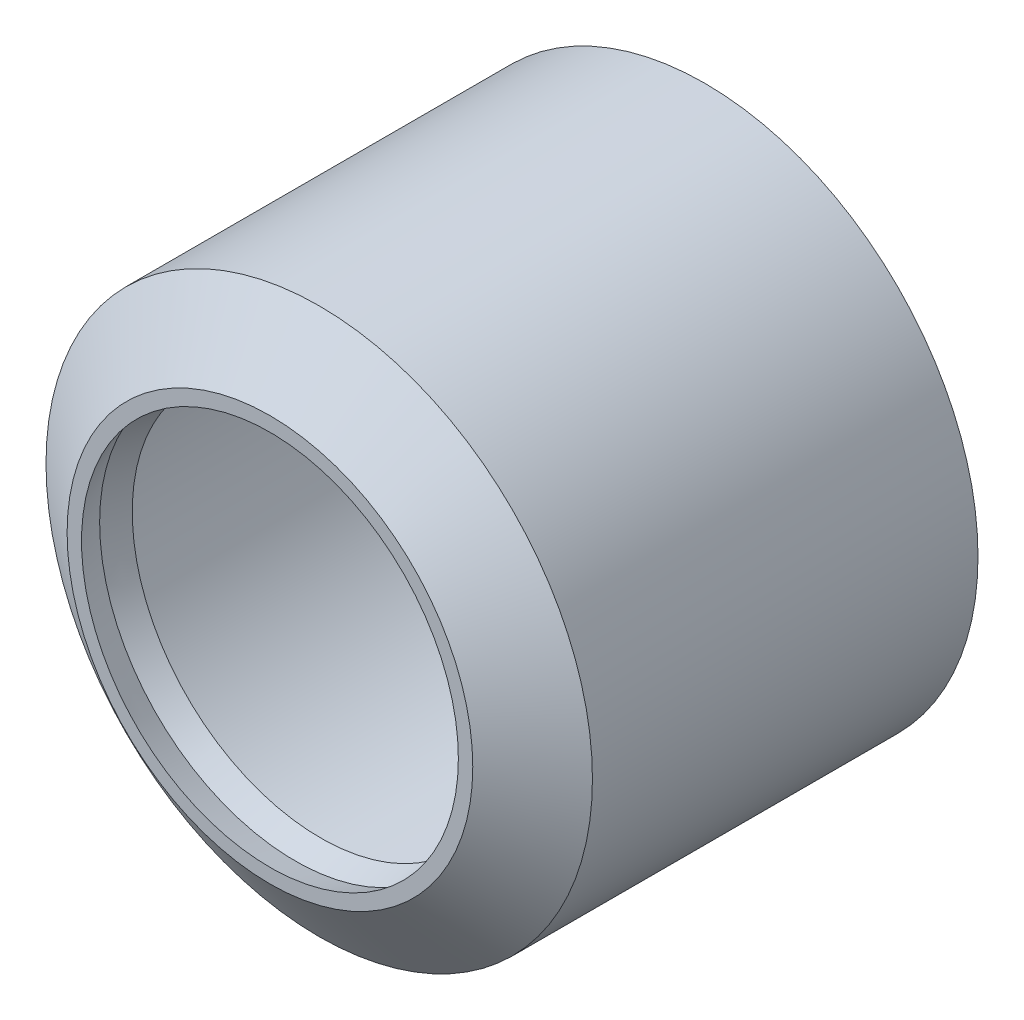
ISO-10303-21;
HEADER;
FILE_DESCRIPTION(('STEP AP214'),'2;1');
FILE_NAME('part.step','',(''),(''),'','','');
FILE_SCHEMA(('AUTOMOTIVE_DESIGN { 1 0 10303 214 1 1 1 1 }'));
ENDSEC;
DATA;
#1=APPLICATION_CONTEXT('core data for automotive mechanical design processes');
#2=APPLICATION_PROTOCOL_DEFINITION('international standard','automotive_design',2000,#1);
#3=PRODUCT_CONTEXT('',#1,'mechanical');
#4=PRODUCT('Part','Part','',(#3));
#5=PRODUCT_RELATED_PRODUCT_CATEGORY('part','',(#4));
#6=PRODUCT_DEFINITION_FORMATION('','',#4);
#7=PRODUCT_DEFINITION_CONTEXT('part definition',#1,'design');
#8=PRODUCT_DEFINITION('design','',#6,#7);
#9=PRODUCT_DEFINITION_SHAPE('','',#8);
#10=(LENGTH_UNIT() NAMED_UNIT(*) SI_UNIT(.MILLI.,.METRE.));
#11=(NAMED_UNIT(*) PLANE_ANGLE_UNIT() SI_UNIT($,.RADIAN.));
#12=(NAMED_UNIT(*) SI_UNIT($,.STERADIAN.) SOLID_ANGLE_UNIT());
#13=UNCERTAINTY_MEASURE_WITH_UNIT(LENGTH_MEASURE(1.E-05),#10,'distance_accuracy_value','');
#14=(GEOMETRIC_REPRESENTATION_CONTEXT(3) GLOBAL_UNCERTAINTY_ASSIGNED_CONTEXT((#13)) GLOBAL_UNIT_ASSIGNED_CONTEXT((#10,
#11,#12)) REPRESENTATION_CONTEXT('',''));
#15=CARTESIAN_POINT('',(0.,0.,0.));
#16=DIRECTION('',(0.,0.,1.));
#17=DIRECTION('',(1.,0.,0.));
#18=AXIS2_PLACEMENT_3D('',#15,#16,#17);
#19=CARTESIAN_POINT('',(0.,0.,-26.5));
#20=DIRECTION('',(0.,0.,1.));
#21=DIRECTION('',(1.,0.,0.));
#22=AXIS2_PLACEMENT_3D('',#19,#20,#21);
#23=CYLINDRICAL_SURFACE('',#22,18.85);
#24=CARTESIAN_POINT('',(0.,0.,0.099999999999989));
#25=DIRECTION('',(0.,0.,1.));
#26=DIRECTION('',(1.,0.,0.));
#27=AXIS2_PLACEMENT_3D('',#24,#25,#26);
#28=CIRCLE('',#27,18.85);
#29=CARTESIAN_POINT('',(18.85,0.,0.099999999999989));
#30=VERTEX_POINT('',#29);
#31=EDGE_CURVE('E10',#30,#30,#28,.F.);
#32=ORIENTED_EDGE('',*,*,#31,.T.);
#33=EDGE_LOOP('',(#32));
#34=FACE_BOUND('',#33,.T.);
#35=CARTESIAN_POINT('',(0.,0.,-26.5));
#36=DIRECTION('',(0.,0.,1.));
#37=DIRECTION('',(1.,0.,0.));
#38=AXIS2_PLACEMENT_3D('',#35,#36,#37);
#39=CIRCLE('',#38,18.85);
#40=CARTESIAN_POINT('',(18.85,0.,-26.5));
#41=VERTEX_POINT('',#40);
#42=EDGE_CURVE('E35',#41,#41,#39,.T.);
#43=ORIENTED_EDGE('',*,*,#42,.T.);
#44=EDGE_LOOP('',(#43));
#45=FACE_BOUND('',#44,.T.);
#46=ADVANCED_FACE('F25',(#34,#45),#23,.T.);
#47=CARTESIAN_POINT('',(0.,0.,-26.5));
#48=DIRECTION('',(0.,0.,1.));
#49=DIRECTION('',(1.,0.,0.));
#50=AXIS2_PLACEMENT_3D('',#47,#48,#49);
#51=PLANE('',#50);
#52=CARTESIAN_POINT('',(0.,0.,-26.5));
#53=DIRECTION('',(0.,0.,1.));
#54=DIRECTION('',(1.,0.,0.));
#55=AXIS2_PLACEMENT_3D('',#52,#53,#54);
#56=CIRCLE('',#55,17.6);
#57=CARTESIAN_POINT('',(17.6,0.,-26.5));
#58=VERTEX_POINT('',#57);
#59=EDGE_CURVE('E39',#58,#58,#56,.T.);
#60=ORIENTED_EDGE('',*,*,#59,.T.);
#61=EDGE_LOOP('',(#60));
#62=FACE_BOUND('',#61,.T.);
#63=ORIENTED_EDGE('',*,*,#42,.F.);
#64=EDGE_LOOP('',(#63));
#65=FACE_BOUND('',#64,.T.);
#66=ADVANCED_FACE('F71',(#62,#65),#51,.F.);
#67=CARTESIAN_POINT('',(0.,0.,-26.5));
#68=DIRECTION('',(0.,0.,1.));
#69=DIRECTION('',(1.,0.,0.));
#70=AXIS2_PLACEMENT_3D('',#67,#68,#69);
#71=CYLINDRICAL_SURFACE('',#70,17.6);
#72=ORIENTED_EDGE('',*,*,#59,.F.);
#73=EDGE_LOOP('',(#72));
#74=FACE_BOUND('',#73,.T.);
#75=CARTESIAN_POINT('',(0.,0.,0.));
#76=DIRECTION('',(0.,0.,1.));
#77=DIRECTION('',(1.,0.,0.));
#78=AXIS2_PLACEMENT_3D('',#75,#76,#77);
#79=CIRCLE('',#78,17.6);
#80=CARTESIAN_POINT('',(17.6,0.,0.));
#81=VERTEX_POINT('',#80);
#82=EDGE_CURVE('E44',#81,#81,#79,.T.);
#83=ORIENTED_EDGE('',*,*,#82,.T.);
#84=EDGE_LOOP('',(#83));
#85=FACE_BOUND('',#84,.T.);
#86=ADVANCED_FACE('F75',(#74,#85),#71,.F.);
#87=CARTESIAN_POINT('',(0.,0.,3.49999999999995));
#88=DIRECTION('',(0.,0.,1.));
#89=DIRECTION('',(1.,0.,0.));
#90=AXIS2_PLACEMENT_3D('',#87,#88,#89);
#91=PLANE('',#90);
#92=CARTESIAN_POINT('',(0.,0.,3.49999999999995));
#93=DIRECTION('',(0.,0.,1.));
#94=DIRECTION('',(1.,0.,0.));
#95=AXIS2_PLACEMENT_3D('',#92,#93,#94);
#96=CIRCLE('',#95,13.9942967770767);
#97=CARTESIAN_POINT('',(13.9942967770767,0.,3.49999999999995));
#98=VERTEX_POINT('',#97);
#99=EDGE_CURVE('E31',#98,#98,#96,.T.);
#100=ORIENTED_EDGE('',*,*,#99,.T.);
#101=EDGE_LOOP('',(#100));
#102=FACE_BOUND('',#101,.T.);
#103=CARTESIAN_POINT('',(0.,0.,3.49999999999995));
#104=DIRECTION('',(0.,0.,1.));
#105=DIRECTION('',(1.,0.,0.));
#106=AXIS2_PLACEMENT_3D('',#103,#104,#105);
#107=CIRCLE('',#106,13.);
#108=CARTESIAN_POINT('',(13.,0.,3.49999999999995));
#109=VERTEX_POINT('',#108);
#110=EDGE_CURVE('E47',#109,#109,#107,.T.);
#111=ORIENTED_EDGE('',*,*,#110,.F.);
#112=EDGE_LOOP('',(#111));
#113=FACE_BOUND('',#112,.T.);
#114=ADVANCED_FACE('F83',(#102,#113),#91,.T.);
#115=CARTESIAN_POINT('',(0.,0.,0.));
#116=DIRECTION('',(0.,0.,1.));
#117=DIRECTION('',(1.,0.,0.));
#118=AXIS2_PLACEMENT_3D('',#115,#116,#117);
#119=PLANE('',#118);
#120=ORIENTED_EDGE('',*,*,#82,.F.);
#121=EDGE_LOOP('',(#120));
#122=FACE_BOUND('',#121,.T.);
#123=CARTESIAN_POINT('',(0.,0.,0.));
#124=DIRECTION('',(0.,0.,1.));
#125=DIRECTION('',(1.,0.,0.));
#126=AXIS2_PLACEMENT_3D('',#123,#124,#125);
#127=CIRCLE('',#126,13.);
#128=CARTESIAN_POINT('',(13.,0.,0.));
#129=VERTEX_POINT('',#128);
#130=EDGE_CURVE('E53',#129,#129,#127,.T.);
#131=ORIENTED_EDGE('',*,*,#130,.T.);
#132=EDGE_LOOP('',(#131));
#133=FACE_BOUND('',#132,.T.);
#134=ADVANCED_FACE('F57',(#122,#133),#119,.F.);
#135=CARTESIAN_POINT('',(0.,0.,3.49999999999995));
#136=DIRECTION('',(0.,0.,-1.));
#137=DIRECTION('',(-1.,0.,0.));
#138=AXIS2_PLACEMENT_3D('',#135,#136,#137);
#139=CONICAL_SURFACE('',#138,13.9942967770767,0.959931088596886);
#140=ORIENTED_EDGE('',*,*,#31,.F.);
#141=EDGE_LOOP('',(#140));
#142=FACE_BOUND('',#141,.T.);
#143=ORIENTED_EDGE('',*,*,#99,.F.);
#144=EDGE_LOOP('',(#143));
#145=FACE_BOUND('',#144,.T.);
#146=ADVANCED_FACE('F67',(#142,#145),#139,.T.);
#147=CARTESIAN_POINT('',(0.,0.,1.75000000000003));
#148=DIRECTION('',(0.,0.,-1.));
#149=DIRECTION('',(-1.,0.,0.));
#150=AXIS2_PLACEMENT_3D('',#147,#148,#149);
#151=CONICAL_SURFACE('',#150,13.5,0.278299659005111);
#152=ORIENTED_EDGE('',*,*,#110,.T.);
#153=EDGE_LOOP('',(#152));
#154=FACE_BOUND('',#153,.T.);
#155=CARTESIAN_POINT('',(0.,0.,1.75000000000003));
#156=DIRECTION('',(0.,0.,1.));
#157=DIRECTION('',(1.,0.,0.));
#158=AXIS2_PLACEMENT_3D('',#155,#156,#157);
#159=CIRCLE('',#158,13.5);
#160=CARTESIAN_POINT('',(13.5,0.,1.75000000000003));
#161=VERTEX_POINT('',#160);
#162=EDGE_CURVE('E50',#161,#161,#159,.T.);
#163=ORIENTED_EDGE('',*,*,#162,.F.);
#164=EDGE_LOOP('',(#163));
#165=FACE_BOUND('',#164,.T.);
#166=ADVANCED_FACE('F61',(#154,#165),#151,.F.);
#167=CARTESIAN_POINT('',(0.,0.,0.));
#168=DIRECTION('',(0.,0.,1.));
#169=DIRECTION('',(1.,0.,0.));
#170=AXIS2_PLACEMENT_3D('',#167,#168,#169);
#171=CONICAL_SURFACE('',#170,13.,0.278299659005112);
#172=ORIENTED_EDGE('',*,*,#162,.T.);
#173=EDGE_LOOP('',(#172));
#174=FACE_BOUND('',#173,.T.);
#175=ORIENTED_EDGE('',*,*,#130,.F.);
#176=EDGE_LOOP('',(#175));
#177=FACE_BOUND('',#176,.T.);
#178=ADVANCED_FACE('F59',(#174,#177),#171,.F.);
#179=CLOSED_SHELL('',(#46,#66,#86,#114,#134,#146,#166,#178));
#180=MANIFOLD_SOLID_BREP('B2',#179);
#181=ADVANCED_BREP_SHAPE_REPRESENTATION('',(#18,#180),#14);
#182=SHAPE_DEFINITION_REPRESENTATION(#9,#181);
ENDSEC;
END-ISO-10303-21;
